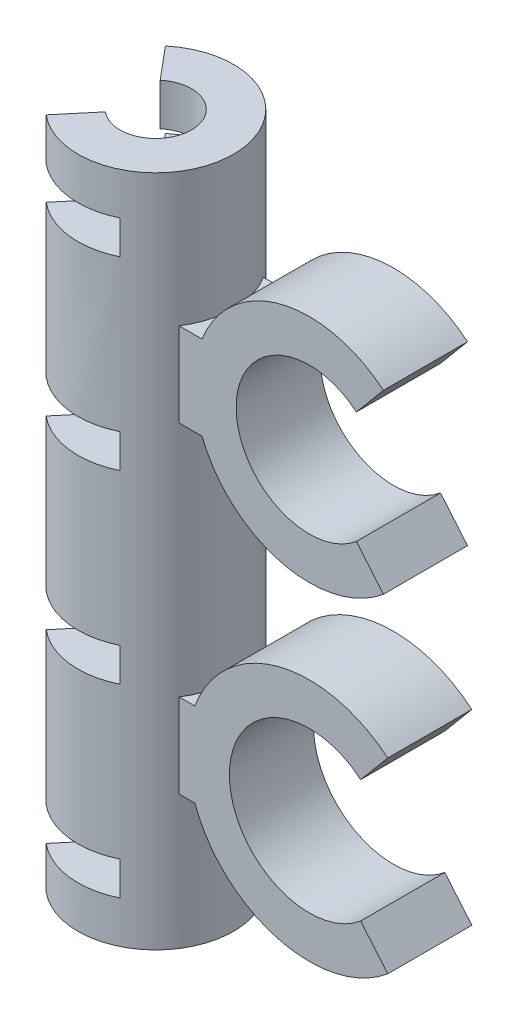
from build123d import *

# Parameters (mm, degrees)
BOSS_EXTRUDE1_DEPTH     = 40
BOSS_EXTRUDE2_DEPTH     = 5
CUT_EXTRUDE1_DEPTH      = 53.406056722
CUT_EXTRUDE1_DEPTH_BACK = 53.406056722
SKETCH5_W               = 10
SKETCH5_H               = 4


with BuildPart() as part:
    # Sketch1 → Boss-Extrude1 (new, symmetric)
    with BuildSketch(Plane(origin=(0, 0, 0), x_dir=(1, 0, 0), z_dir=(0, 1, 0))):
        with BuildLine():
            Line((-2.731847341, 3.255688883), (-5.94578539, 7.085911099))
            ThreePointArc((-5.94578539, 7.085911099), (9.25, 0), (-5.94578539, -7.085911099))
            Line((-5.94578539, -7.085911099), (-2.731847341, -3.255688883))
            ThreePointArc((-2.731847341, -3.255688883), (4.25, 0), (-2.731847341, 3.255688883))
        make_face()
    extrude(amount=BOSS_EXTRUDE1_DEPTH, both=True)

    # Sketch2 → Boss-Extrude2 (add, symmetric)
    with BuildSketch(Plane.XY):
        with BuildLine():
            ThreePointArc((10.49500098, 14.1), (9.55, 19.1), (10.49500098, 24.1))
            Line((10.49500098, 24.1), (4.25, 24.1))
            Line((4.25, 24.1), (4.25, 14.1))
            Line((4.25, 14.1), (10.49500098, 14.1))
        make_face()
        with BuildLine():
            Line((32.056190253, 29.594808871), (28.842252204, 25.764586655))
            ThreePointArc((28.842252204, 25.764586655), (14.55, 19.1), (28.842252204, 12.435413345))
            Line((28.842252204, 12.435413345), (32.056190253, 8.605191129))
            ThreePointArc((32.056190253, 8.605191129), (9.55, 19.1), (32.056190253, 29.594808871))
        make_face()
        with BuildLine():
            Line((4.25, -24.1), (9.639342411, -24.1))
            ThreePointArc((9.639342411, -24.1), (8.75, -19.1), (9.639342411, -14.1))
            Line((9.639342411, -14.1), (4.25, -14.1))
            Line((4.25, -14.1), (4.25, -24.1))
        make_face()
        with BuildLine():
            Line((32.57042034, -7.992355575), (29.356482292, -11.82257779))
            ThreePointArc((29.356482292, -11.82257779), (13.75, -19.1), (29.356482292, -26.37742221))
            Line((29.356482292, -26.37742221), (32.57042034, -30.207644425))
            ThreePointArc((32.57042034, -30.207644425), (8.75, -19.1), (32.57042034, -7.992355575))
        make_face()
    extrude(amount=BOSS_EXTRUDE2_DEPTH, both=True)

    # Sketch5 → Cut-Extrude1 (cut, two sides: drawn at the far end of the back side and taken through both)
    with BuildSketch(Plane.XY.offset(-CUT_EXTRUDE1_DEPTH_BACK)):
        with Locations((-0.94578539, 33)):
            Rectangle(SKETCH5_W, SKETCH5_H)
        with Locations((-0.94578539, 11)):
            Rectangle(SKETCH5_W, SKETCH5_H)
        with Locations((-0.94578539, -11)):
            Rectangle(SKETCH5_W, SKETCH5_H)
        with Locations((-0.94578539, -33)):
            Rectangle(SKETCH5_W, SKETCH5_H)
    extrude(amount=CUT_EXTRUDE1_DEPTH + CUT_EXTRUDE1_DEPTH_BACK, mode=Mode.SUBTRACT)


solid = part.part
